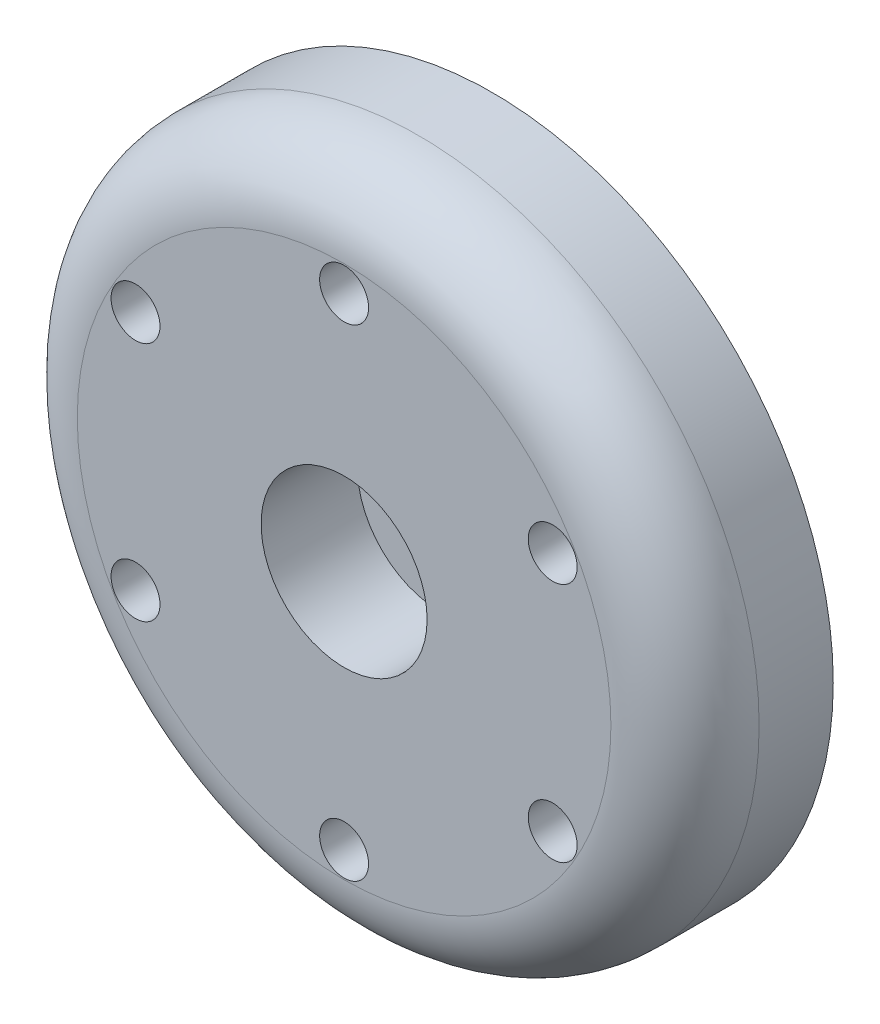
ISO-10303-21;
HEADER;
FILE_DESCRIPTION(('STEP AP214'),'2;1');
FILE_NAME('part.step','',(''),(''),'','','');
FILE_SCHEMA(('AUTOMOTIVE_DESIGN { 1 0 10303 214 1 1 1 1 }'));
ENDSEC;
DATA;
#1=APPLICATION_CONTEXT('core data for automotive mechanical design processes');
#2=APPLICATION_PROTOCOL_DEFINITION('international standard','automotive_design',2000,#1);
#3=PRODUCT_CONTEXT('',#1,'mechanical');
#4=PRODUCT('Part','Part','',(#3));
#5=PRODUCT_RELATED_PRODUCT_CATEGORY('part','',(#4));
#6=PRODUCT_DEFINITION_FORMATION('','',#4);
#7=PRODUCT_DEFINITION_CONTEXT('part definition',#1,'design');
#8=PRODUCT_DEFINITION('design','',#6,#7);
#9=PRODUCT_DEFINITION_SHAPE('','',#8);
#10=(LENGTH_UNIT() NAMED_UNIT(*) SI_UNIT(.MILLI.,.METRE.));
#11=(NAMED_UNIT(*) PLANE_ANGLE_UNIT() SI_UNIT($,.RADIAN.));
#12=(NAMED_UNIT(*) SI_UNIT($,.STERADIAN.) SOLID_ANGLE_UNIT());
#13=UNCERTAINTY_MEASURE_WITH_UNIT(LENGTH_MEASURE(1.E-05),#10,'distance_accuracy_value','');
#14=(GEOMETRIC_REPRESENTATION_CONTEXT(3) GLOBAL_UNCERTAINTY_ASSIGNED_CONTEXT((#13)) GLOBAL_UNIT_ASSIGNED_CONTEXT((#10,
#11,#12)) REPRESENTATION_CONTEXT('',''));
#15=CARTESIAN_POINT('',(0.,0.,0.));
#16=DIRECTION('',(0.,0.,1.));
#17=DIRECTION('',(1.,0.,0.));
#18=AXIS2_PLACEMENT_3D('',#15,#16,#17);
#19=CARTESIAN_POINT('',(0.,0.,10.));
#20=DIRECTION('',(0.,0.,-1.));
#21=DIRECTION('',(-1.,0.,0.));
#22=AXIS2_PLACEMENT_3D('',#19,#20,#21);
#23=CYLINDRICAL_SURFACE('',#22,23.);
#24=CARTESIAN_POINT('',(0.,0.,5.));
#25=DIRECTION('',(0.,0.,1.));
#26=DIRECTION('',(1.,0.,0.));
#27=AXIS2_PLACEMENT_3D('',#24,#25,#26);
#28=CIRCLE('',#27,23.);
#29=CARTESIAN_POINT('',(23.,0.,5.));
#30=VERTEX_POINT('',#29);
#31=EDGE_CURVE('E38',#30,#30,#28,.F.);
#32=ORIENTED_EDGE('',*,*,#31,.T.);
#33=EDGE_LOOP('',(#32));
#34=FACE_BOUND('',#33,.T.);
#35=CARTESIAN_POINT('',(0.,0.,0.));
#36=DIRECTION('',(0.,0.,-1.));
#37=DIRECTION('',(-1.,0.,0.));
#38=AXIS2_PLACEMENT_3D('',#35,#36,#37);
#39=CIRCLE('',#38,23.);
#40=CARTESIAN_POINT('',(-23.,0.,0.));
#41=VERTEX_POINT('',#40);
#42=EDGE_CURVE('E42',#41,#41,#39,.T.);
#43=ORIENTED_EDGE('',*,*,#42,.F.);
#44=EDGE_LOOP('',(#43));
#45=FACE_BOUND('',#44,.T.);
#46=ADVANCED_FACE('F31',(#34,#45),#23,.T.);
#47=CARTESIAN_POINT('',(23.,0.,10.));
#48=DIRECTION('',(0.,0.,1.));
#49=DIRECTION('',(1.,0.,0.));
#50=AXIS2_PLACEMENT_3D('',#47,#48,#49);
#51=PLANE('',#50);
#52=CARTESIAN_POINT('',(0.,0.,10.));
#53=DIRECTION('',(0.,0.,1.));
#54=DIRECTION('',(1.,0.,0.));
#55=AXIS2_PLACEMENT_3D('',#52,#53,#54);
#56=CIRCLE('',#55,18.);
#57=CARTESIAN_POINT('',(18.,0.,10.));
#58=VERTEX_POINT('',#57);
#59=EDGE_CURVE('E10',#58,#58,#56,.T.);
#60=ORIENTED_EDGE('',*,*,#59,.T.);
#61=EDGE_LOOP('',(#60));
#62=FACE_BOUND('',#61,.T.);
#63=CARTESIAN_POINT('',(0.,0.,10.));
#64=DIRECTION('',(0.,0.,1.));
#65=DIRECTION('',(1.,0.,0.));
#66=AXIS2_PLACEMENT_3D('',#63,#64,#65);
#67=CIRCLE('',#66,5.59999999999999);
#68=CARTESIAN_POINT('',(5.59999999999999,0.,10.));
#69=VERTEX_POINT('',#68);
#70=EDGE_CURVE('E105',#69,#69,#67,.T.);
#71=ORIENTED_EDGE('',*,*,#70,.F.);
#72=EDGE_LOOP('',(#71));
#73=FACE_BOUND('',#72,.T.);
#74=CARTESIAN_POINT('',(14.072912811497,8.12500000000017,10.));
#75=DIRECTION('',(0.,0.,1.));
#76=DIRECTION('',(1.,0.,0.));
#77=AXIS2_PLACEMENT_3D('',#74,#75,#76);
#78=CIRCLE('',#77,1.64999999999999);
#79=CARTESIAN_POINT('',(15.722912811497,8.12500000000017,10.));
#80=VERTEX_POINT('',#79);
#81=EDGE_CURVE('E53',#80,#80,#78,.T.);
#82=ORIENTED_EDGE('',*,*,#81,.F.);
#83=EDGE_LOOP('',(#82));
#84=FACE_BOUND('',#83,.T.);
#85=CARTESIAN_POINT('',(14.0729128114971,-8.12500000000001,10.));
#86=DIRECTION('',(0.,0.,1.));
#87=DIRECTION('',(1.,0.,0.));
#88=AXIS2_PLACEMENT_3D('',#85,#86,#87);
#89=CIRCLE('',#88,1.64999999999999);
#90=CARTESIAN_POINT('',(15.7229128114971,-8.12500000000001,10.));
#91=VERTEX_POINT('',#90);
#92=EDGE_CURVE('E52',#91,#91,#89,.T.);
#93=ORIENTED_EDGE('',*,*,#92,.F.);
#94=EDGE_LOOP('',(#93));
#95=FACE_BOUND('',#94,.T.);
#96=CARTESIAN_POINT('',(1.13473143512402E-13,-16.25,10.));
#97=DIRECTION('',(0.,0.,1.));
#98=DIRECTION('',(1.,0.,0.));
#99=AXIS2_PLACEMENT_3D('',#96,#97,#98);
#100=CIRCLE('',#99,1.64999999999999);
#101=CARTESIAN_POINT('',(1.6500000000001,-16.25,10.));
#102=VERTEX_POINT('',#101);
#103=EDGE_CURVE('E57',#102,#102,#100,.T.);
#104=ORIENTED_EDGE('',*,*,#103,.F.);
#105=EDGE_LOOP('',(#104));
#106=FACE_BOUND('',#105,.T.);
#107=CARTESIAN_POINT('',(-14.0729128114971,-8.12500000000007,10.));
#108=DIRECTION('',(0.,0.,1.));
#109=DIRECTION('',(1.,0.,0.));
#110=AXIS2_PLACEMENT_3D('',#107,#108,#109);
#111=CIRCLE('',#110,1.64999999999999);
#112=CARTESIAN_POINT('',(-12.4229128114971,-8.12500000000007,10.));
#113=VERTEX_POINT('',#112);
#114=EDGE_CURVE('E61',#113,#113,#111,.T.);
#115=ORIENTED_EDGE('',*,*,#114,.F.);
#116=EDGE_LOOP('',(#115));
#117=FACE_BOUND('',#116,.T.);
#118=CARTESIAN_POINT('',(-14.0729128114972,8.12499999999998,10.));
#119=DIRECTION('',(0.,0.,1.));
#120=DIRECTION('',(1.,0.,0.));
#121=AXIS2_PLACEMENT_3D('',#118,#119,#120);
#122=CIRCLE('',#121,1.64999999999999);
#123=CARTESIAN_POINT('',(-12.4229128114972,8.12499999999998,10.));
#124=VERTEX_POINT('',#123);
#125=EDGE_CURVE('E65',#124,#124,#122,.T.);
#126=ORIENTED_EDGE('',*,*,#125,.F.);
#127=EDGE_LOOP('',(#126));
#128=FACE_BOUND('',#127,.T.);
#129=CARTESIAN_POINT('',(0.,16.25,10.));
#130=DIRECTION('',(0.,0.,1.));
#131=DIRECTION('',(1.,0.,0.));
#132=AXIS2_PLACEMENT_3D('',#129,#130,#131);
#133=CIRCLE('',#132,1.64999999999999);
#134=CARTESIAN_POINT('',(1.64999999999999,16.25,10.));
#135=VERTEX_POINT('',#134);
#136=EDGE_CURVE('E69',#135,#135,#133,.T.);
#137=ORIENTED_EDGE('',*,*,#136,.F.);
#138=EDGE_LOOP('',(#137));
#139=FACE_BOUND('',#138,.T.);
#140=ADVANCED_FACE('F111',(#62,#73,#84,#95,#106,#117,#128,#139),#51,.T.);
#141=CARTESIAN_POINT('',(0.,0.,0.));
#142=DIRECTION('',(0.,0.,-1.));
#143=DIRECTION('',(-1.,0.,0.));
#144=AXIS2_PLACEMENT_3D('',#141,#142,#143);
#145=PLANE('',#144);
#146=CARTESIAN_POINT('',(0.,0.,0.));
#147=DIRECTION('',(0.,0.,-1.));
#148=DIRECTION('',(-1.,0.,0.));
#149=AXIS2_PLACEMENT_3D('',#146,#147,#148);
#150=CIRCLE('',#149,20.);
#151=CARTESIAN_POINT('',(-20.,0.,0.));
#152=VERTEX_POINT('',#151);
#153=EDGE_CURVE('E76',#152,#152,#150,.T.);
#154=ORIENTED_EDGE('',*,*,#153,.F.);
#155=EDGE_LOOP('',(#154));
#156=FACE_BOUND('',#155,.T.);
#157=ORIENTED_EDGE('',*,*,#42,.T.);
#158=EDGE_LOOP('',(#157));
#159=FACE_BOUND('',#158,.T.);
#160=ADVANCED_FACE('F114',(#156,#159),#145,.T.);
#161=CARTESIAN_POINT('',(0.,0.,5.8));
#162=DIRECTION('',(0.,0.,1.));
#163=DIRECTION('',(1.,0.,0.));
#164=AXIS2_PLACEMENT_3D('',#161,#162,#163);
#165=PLANE('',#164);
#166=CARTESIAN_POINT('',(14.072912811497,8.12500000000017,5.8));
#167=DIRECTION('',(0.,0.,1.));
#168=DIRECTION('',(1.,0.,0.));
#169=AXIS2_PLACEMENT_3D('',#166,#167,#168);
#170=CIRCLE('',#169,1.64999999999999);
#171=CARTESIAN_POINT('',(15.722912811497,8.12500000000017,5.8));
#172=VERTEX_POINT('',#171);
#173=EDGE_CURVE('E49',#172,#172,#170,.T.);
#174=ORIENTED_EDGE('',*,*,#173,.T.);
#175=EDGE_LOOP('',(#174));
#176=FACE_BOUND('',#175,.T.);
#177=CARTESIAN_POINT('',(14.0729128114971,-8.12500000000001,5.8));
#178=DIRECTION('',(0.,0.,1.));
#179=DIRECTION('',(1.,0.,0.));
#180=AXIS2_PLACEMENT_3D('',#177,#178,#179);
#181=CIRCLE('',#180,1.64999999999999);
#182=CARTESIAN_POINT('',(15.7229128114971,-8.12500000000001,5.8));
#183=VERTEX_POINT('',#182);
#184=EDGE_CURVE('E54',#183,#183,#181,.T.);
#185=ORIENTED_EDGE('',*,*,#184,.T.);
#186=EDGE_LOOP('',(#185));
#187=FACE_BOUND('',#186,.T.);
#188=CARTESIAN_POINT('',(1.13473143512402E-13,-16.25,5.8));
#189=DIRECTION('',(0.,0.,1.));
#190=DIRECTION('',(1.,0.,0.));
#191=AXIS2_PLACEMENT_3D('',#188,#189,#190);
#192=CIRCLE('',#191,1.64999999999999);
#193=CARTESIAN_POINT('',(1.6500000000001,-16.25,5.8));
#194=VERTEX_POINT('',#193);
#195=EDGE_CURVE('E58',#194,#194,#192,.T.);
#196=ORIENTED_EDGE('',*,*,#195,.T.);
#197=EDGE_LOOP('',(#196));
#198=FACE_BOUND('',#197,.T.);
#199=CARTESIAN_POINT('',(-14.0729128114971,-8.12500000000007,5.8));
#200=DIRECTION('',(0.,0.,1.));
#201=DIRECTION('',(1.,0.,0.));
#202=AXIS2_PLACEMENT_3D('',#199,#200,#201);
#203=CIRCLE('',#202,1.64999999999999);
#204=CARTESIAN_POINT('',(-12.4229128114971,-8.12500000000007,5.8));
#205=VERTEX_POINT('',#204);
#206=EDGE_CURVE('E62',#205,#205,#203,.T.);
#207=ORIENTED_EDGE('',*,*,#206,.T.);
#208=EDGE_LOOP('',(#207));
#209=FACE_BOUND('',#208,.T.);
#210=CARTESIAN_POINT('',(-14.0729128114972,8.12499999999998,5.8));
#211=DIRECTION('',(0.,0.,1.));
#212=DIRECTION('',(1.,0.,0.));
#213=AXIS2_PLACEMENT_3D('',#210,#211,#212);
#214=CIRCLE('',#213,1.64999999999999);
#215=CARTESIAN_POINT('',(-12.4229128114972,8.12499999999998,5.8));
#216=VERTEX_POINT('',#215);
#217=EDGE_CURVE('E66',#216,#216,#214,.T.);
#218=ORIENTED_EDGE('',*,*,#217,.T.);
#219=EDGE_LOOP('',(#218));
#220=FACE_BOUND('',#219,.T.);
#221=CARTESIAN_POINT('',(0.,16.25,5.8));
#222=DIRECTION('',(0.,0.,1.));
#223=DIRECTION('',(1.,0.,0.));
#224=AXIS2_PLACEMENT_3D('',#221,#222,#223);
#225=CIRCLE('',#224,1.64999999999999);
#226=CARTESIAN_POINT('',(1.64999999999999,16.25,5.8));
#227=VERTEX_POINT('',#226);
#228=EDGE_CURVE('E70',#227,#227,#225,.T.);
#229=ORIENTED_EDGE('',*,*,#228,.T.);
#230=EDGE_LOOP('',(#229));
#231=FACE_BOUND('',#230,.T.);
#232=CARTESIAN_POINT('',(0.,0.,5.8));
#233=DIRECTION('',(0.,0.,-1.));
#234=DIRECTION('',(-1.,0.,0.));
#235=AXIS2_PLACEMENT_3D('',#232,#233,#234);
#236=CIRCLE('',#235,12.5);
#237=CARTESIAN_POINT('',(-12.5,0.,5.8));
#238=VERTEX_POINT('',#237);
#239=EDGE_CURVE('E79',#238,#238,#236,.T.);
#240=ORIENTED_EDGE('',*,*,#239,.F.);
#241=EDGE_LOOP('',(#240));
#242=FACE_BOUND('',#241,.T.);
#243=CARTESIAN_POINT('',(0.,0.,5.8));
#244=DIRECTION('',(0.,0.,-1.));
#245=DIRECTION('',(-1.,0.,0.));
#246=AXIS2_PLACEMENT_3D('',#243,#244,#245);
#247=CIRCLE('',#246,20.);
#248=CARTESIAN_POINT('',(-20.,0.,5.8));
#249=VERTEX_POINT('',#248);
#250=EDGE_CURVE('E46',#249,#249,#247,.T.);
#251=ORIENTED_EDGE('',*,*,#250,.T.);
#252=EDGE_LOOP('',(#251));
#253=FACE_BOUND('',#252,.T.);
#254=ADVANCED_FACE('F136',(#176,#187,#198,#209,#220,#231,#242,#253),#165,.F.);
#255=CARTESIAN_POINT('',(0.,0.,0.));
#256=DIRECTION('',(0.,0.,-1.));
#257=DIRECTION('',(-1.,0.,0.));
#258=AXIS2_PLACEMENT_3D('',#255,#256,#257);
#259=CYLINDRICAL_SURFACE('',#258,20.);
#260=ORIENTED_EDGE('',*,*,#250,.F.);
#261=EDGE_LOOP('',(#260));
#262=FACE_BOUND('',#261,.T.);
#263=ORIENTED_EDGE('',*,*,#153,.T.);
#264=EDGE_LOOP('',(#263));
#265=FACE_BOUND('',#264,.T.);
#266=ADVANCED_FACE('F139',(#262,#265),#259,.F.);
#267=CARTESIAN_POINT('',(0.,0.,5.8));
#268=DIRECTION('',(0.,0.,-1.));
#269=DIRECTION('',(-1.,0.,0.));
#270=AXIS2_PLACEMENT_3D('',#267,#268,#269);
#271=CYLINDRICAL_SURFACE('',#270,12.5);
#272=ORIENTED_EDGE('',*,*,#239,.T.);
#273=EDGE_LOOP('',(#272));
#274=FACE_BOUND('',#273,.T.);
#275=CARTESIAN_POINT('',(0.,0.,0.));
#276=DIRECTION('',(0.,0.,-1.));
#277=DIRECTION('',(-1.,0.,0.));
#278=AXIS2_PLACEMENT_3D('',#275,#276,#277);
#279=CIRCLE('',#278,12.5);
#280=CARTESIAN_POINT('',(-12.5,0.,0.));
#281=VERTEX_POINT('',#280);
#282=EDGE_CURVE('E72',#281,#281,#279,.T.);
#283=ORIENTED_EDGE('',*,*,#282,.F.);
#284=EDGE_LOOP('',(#283));
#285=FACE_BOUND('',#284,.T.);
#286=ADVANCED_FACE('F148',(#274,#285),#271,.T.);
#287=CARTESIAN_POINT('',(0.,0.,0.));
#288=DIRECTION('',(0.,0.,-1.));
#289=DIRECTION('',(-1.,0.,0.));
#290=AXIS2_PLACEMENT_3D('',#287,#288,#289);
#291=PLANE('',#290);
#292=CARTESIAN_POINT('',(0.,0.,0.));
#293=DIRECTION('',(0.,0.,1.));
#294=DIRECTION('',(1.,0.,0.));
#295=AXIS2_PLACEMENT_3D('',#292,#293,#294);
#296=CIRCLE('',#295,3.02250000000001);
#297=CARTESIAN_POINT('',(3.02250000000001,0.,0.));
#298=VERTEX_POINT('',#297);
#299=EDGE_CURVE('E96',#298,#298,#296,.T.);
#300=ORIENTED_EDGE('',*,*,#299,.T.);
#301=EDGE_LOOP('',(#300));
#302=FACE_BOUND('',#301,.T.);
#303=ORIENTED_EDGE('',*,*,#282,.T.);
#304=EDGE_LOOP('',(#303));
#305=FACE_BOUND('',#304,.T.);
#306=ADVANCED_FACE('F132',(#302,#305),#291,.T.);
#307=CARTESIAN_POINT('',(0.,16.25,10.));
#308=DIRECTION('',(0.,0.,1.));
#309=DIRECTION('',(1.,0.,0.));
#310=AXIS2_PLACEMENT_3D('',#307,#308,#309);
#311=CYLINDRICAL_SURFACE('',#310,1.64999999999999);
#312=ORIENTED_EDGE('',*,*,#136,.T.);
#313=EDGE_LOOP('',(#312));
#314=FACE_BOUND('',#313,.T.);
#315=ORIENTED_EDGE('',*,*,#228,.F.);
#316=EDGE_LOOP('',(#315));
#317=FACE_BOUND('',#316,.T.);
#318=ADVANCED_FACE('F128',(#314,#317),#311,.F.);
#319=CARTESIAN_POINT('',(-14.0729128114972,8.12499999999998,10.));
#320=DIRECTION('',(0.,0.,1.));
#321=DIRECTION('',(1.,0.,0.));
#322=AXIS2_PLACEMENT_3D('',#319,#320,#321);
#323=CYLINDRICAL_SURFACE('',#322,1.64999999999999);
#324=ORIENTED_EDGE('',*,*,#125,.T.);
#325=EDGE_LOOP('',(#324));
#326=FACE_BOUND('',#325,.T.);
#327=ORIENTED_EDGE('',*,*,#217,.F.);
#328=EDGE_LOOP('',(#327));
#329=FACE_BOUND('',#328,.T.);
#330=ADVANCED_FACE('F131',(#326,#329),#323,.F.);
#331=CARTESIAN_POINT('',(-14.0729128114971,-8.12500000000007,10.));
#332=DIRECTION('',(0.,0.,1.));
#333=DIRECTION('',(1.,0.,0.));
#334=AXIS2_PLACEMENT_3D('',#331,#332,#333);
#335=CYLINDRICAL_SURFACE('',#334,1.64999999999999);
#336=ORIENTED_EDGE('',*,*,#114,.T.);
#337=EDGE_LOOP('',(#336));
#338=FACE_BOUND('',#337,.T.);
#339=ORIENTED_EDGE('',*,*,#206,.F.);
#340=EDGE_LOOP('',(#339));
#341=FACE_BOUND('',#340,.T.);
#342=ADVANCED_FACE('F169',(#338,#341),#335,.F.);
#343=CARTESIAN_POINT('',(1.13473143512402E-13,-16.25,10.));
#344=DIRECTION('',(0.,0.,1.));
#345=DIRECTION('',(1.,0.,0.));
#346=AXIS2_PLACEMENT_3D('',#343,#344,#345);
#347=CYLINDRICAL_SURFACE('',#346,1.64999999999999);
#348=ORIENTED_EDGE('',*,*,#103,.T.);
#349=EDGE_LOOP('',(#348));
#350=FACE_BOUND('',#349,.T.);
#351=ORIENTED_EDGE('',*,*,#195,.F.);
#352=EDGE_LOOP('',(#351));
#353=FACE_BOUND('',#352,.T.);
#354=ADVANCED_FACE('F173',(#350,#353),#347,.F.);
#355=CARTESIAN_POINT('',(14.0729128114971,-8.12500000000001,10.));
#356=DIRECTION('',(0.,0.,1.));
#357=DIRECTION('',(1.,0.,0.));
#358=AXIS2_PLACEMENT_3D('',#355,#356,#357);
#359=CYLINDRICAL_SURFACE('',#358,1.64999999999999);
#360=ORIENTED_EDGE('',*,*,#92,.T.);
#361=EDGE_LOOP('',(#360));
#362=FACE_BOUND('',#361,.T.);
#363=ORIENTED_EDGE('',*,*,#184,.F.);
#364=EDGE_LOOP('',(#363));
#365=FACE_BOUND('',#364,.T.);
#366=ADVANCED_FACE('F177',(#362,#365),#359,.F.);
#367=CARTESIAN_POINT('',(14.072912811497,8.12500000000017,10.));
#368=DIRECTION('',(0.,0.,1.));
#369=DIRECTION('',(1.,0.,0.));
#370=AXIS2_PLACEMENT_3D('',#367,#368,#369);
#371=CYLINDRICAL_SURFACE('',#370,1.64999999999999);
#372=ORIENTED_EDGE('',*,*,#81,.T.);
#373=EDGE_LOOP('',(#372));
#374=FACE_BOUND('',#373,.T.);
#375=ORIENTED_EDGE('',*,*,#173,.F.);
#376=EDGE_LOOP('',(#375));
#377=FACE_BOUND('',#376,.T.);
#378=ADVANCED_FACE('F181',(#374,#377),#371,.F.);
#379=CARTESIAN_POINT('',(0.,0.,10.));
#380=DIRECTION('',(0.,0.,1.));
#381=DIRECTION('',(1.,0.,0.));
#382=AXIS2_PLACEMENT_3D('',#379,#380,#381);
#383=CYLINDRICAL_SURFACE('',#382,3.02250000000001);
#384=ORIENTED_EDGE('',*,*,#299,.F.);
#385=EDGE_LOOP('',(#384));
#386=FACE_BOUND('',#385,.T.);
#387=CARTESIAN_POINT('',(0.,0.,3.5));
#388=DIRECTION('',(0.,0.,1.));
#389=DIRECTION('',(1.,0.,0.));
#390=AXIS2_PLACEMENT_3D('',#387,#388,#389);
#391=CIRCLE('',#390,3.02250000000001);
#392=CARTESIAN_POINT('',(3.02250000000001,0.,3.5));
#393=VERTEX_POINT('',#392);
#394=EDGE_CURVE('E99',#393,#393,#391,.T.);
#395=ORIENTED_EDGE('',*,*,#394,.T.);
#396=EDGE_LOOP('',(#395));
#397=FACE_BOUND('',#396,.T.);
#398=ADVANCED_FACE('F185',(#386,#397),#383,.F.);
#399=CARTESIAN_POINT('',(3.02250000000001,0.,3.5));
#400=DIRECTION('',(0.,0.,-1.));
#401=DIRECTION('',(-1.,0.,0.));
#402=AXIS2_PLACEMENT_3D('',#399,#400,#401);
#403=PLANE('',#402);
#404=ORIENTED_EDGE('',*,*,#394,.F.);
#405=EDGE_LOOP('',(#404));
#406=FACE_BOUND('',#405,.T.);
#407=CARTESIAN_POINT('',(0.,0.,3.5));
#408=DIRECTION('',(0.,0.,1.));
#409=DIRECTION('',(1.,0.,0.));
#410=AXIS2_PLACEMENT_3D('',#407,#408,#409);
#411=CIRCLE('',#410,5.59999999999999);
#412=CARTESIAN_POINT('',(5.59999999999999,0.,3.5));
#413=VERTEX_POINT('',#412);
#414=EDGE_CURVE('E102',#413,#413,#411,.T.);
#415=ORIENTED_EDGE('',*,*,#414,.T.);
#416=EDGE_LOOP('',(#415));
#417=FACE_BOUND('',#416,.T.);
#418=ADVANCED_FACE('F189',(#406,#417),#403,.F.);
#419=CARTESIAN_POINT('',(0.,0.,10.));
#420=DIRECTION('',(0.,0.,1.));
#421=DIRECTION('',(1.,0.,0.));
#422=AXIS2_PLACEMENT_3D('',#419,#420,#421);
#423=CYLINDRICAL_SURFACE('',#422,5.59999999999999);
#424=ORIENTED_EDGE('',*,*,#414,.F.);
#425=EDGE_LOOP('',(#424));
#426=FACE_BOUND('',#425,.T.);
#427=ORIENTED_EDGE('',*,*,#70,.T.);
#428=EDGE_LOOP('',(#427));
#429=FACE_BOUND('',#428,.T.);
#430=ADVANCED_FACE('F109',(#426,#429),#423,.F.);
#431=CARTESIAN_POINT('',(0.,0.,5.));
#432=DIRECTION('',(0.,0.,1.));
#433=DIRECTION('',(1.,0.,0.));
#434=AXIS2_PLACEMENT_3D('',#431,#432,#433);
#435=TOROIDAL_SURFACE('',#434,18.,5.);
#436=ORIENTED_EDGE('',*,*,#59,.F.);
#437=EDGE_LOOP('',(#436));
#438=FACE_BOUND('',#437,.T.);
#439=ORIENTED_EDGE('',*,*,#31,.F.);
#440=EDGE_LOOP('',(#439));
#441=FACE_BOUND('',#440,.T.);
#442=ADVANCED_FACE('F33',(#438,#441),#435,.T.);
#443=CLOSED_SHELL('',(#46,#140,#160,#254,#266,#286,#306,#318,#330,#342,#354,#366,#378,#398,#418,
#430,#442));
#444=MANIFOLD_SOLID_BREP('B2',#443);
#445=ADVANCED_BREP_SHAPE_REPRESENTATION('',(#18,#444),#14);
#446=SHAPE_DEFINITION_REPRESENTATION(#9,#445);
ENDSEC;
END-ISO-10303-21;
